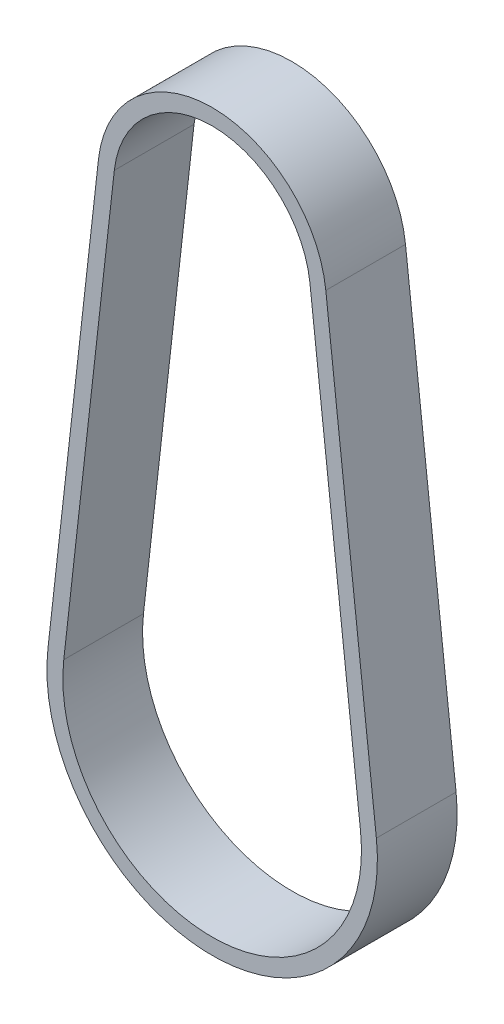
ISO-10303-21;
HEADER;
FILE_DESCRIPTION(('STEP AP214'),'2;1');
FILE_NAME('part.step','',(''),(''),'','','');
FILE_SCHEMA(('AUTOMOTIVE_DESIGN { 1 0 10303 214 1 1 1 1 }'));
ENDSEC;
DATA;
#1=APPLICATION_CONTEXT('core data for automotive mechanical design processes');
#2=APPLICATION_PROTOCOL_DEFINITION('international standard','automotive_design',2000,#1);
#3=PRODUCT_CONTEXT('',#1,'mechanical');
#4=PRODUCT('Part','Part','',(#3));
#5=PRODUCT_RELATED_PRODUCT_CATEGORY('part','',(#4));
#6=PRODUCT_DEFINITION_FORMATION('','',#4);
#7=PRODUCT_DEFINITION_CONTEXT('part definition',#1,'design');
#8=PRODUCT_DEFINITION('design','',#6,#7);
#9=PRODUCT_DEFINITION_SHAPE('','',#8);
#10=(LENGTH_UNIT() NAMED_UNIT(*) SI_UNIT(.MILLI.,.METRE.));
#11=(NAMED_UNIT(*) PLANE_ANGLE_UNIT() SI_UNIT($,.RADIAN.));
#12=(NAMED_UNIT(*) SI_UNIT($,.STERADIAN.) SOLID_ANGLE_UNIT());
#13=UNCERTAINTY_MEASURE_WITH_UNIT(LENGTH_MEASURE(1.E-05),#10,'distance_accuracy_value','');
#14=(GEOMETRIC_REPRESENTATION_CONTEXT(3) GLOBAL_UNCERTAINTY_ASSIGNED_CONTEXT((#13)) GLOBAL_UNIT_ASSIGNED_CONTEXT((#10,
#11,#12)) REPRESENTATION_CONTEXT('',''));
#15=CARTESIAN_POINT('',(0.,0.,0.));
#16=DIRECTION('',(0.,0.,1.));
#17=DIRECTION('',(1.,0.,0.));
#18=AXIS2_PLACEMENT_3D('',#15,#16,#17);
#19=CARTESIAN_POINT('',(-21.3898635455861,2.40818655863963,7.5));
#20=DIRECTION('',(-0.993721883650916,0.11187858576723,0.));
#21=DIRECTION('',(-0.11187858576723,-0.993721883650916,0.));
#22=AXIS2_PLACEMENT_3D('',#19,#20,#21);
#23=PLANE('',#22);
#24=DIRECTION('',(0.11187858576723,0.993721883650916,0.));
#25=VECTOR('',#24,1.);
#26=CARTESIAN_POINT('',(-21.3898635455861,2.40818655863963,-7.5));
#27=LINE('',#26,#25);
#28=CARTESIAN_POINT('',(-30.9047505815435,-82.1044250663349,-7.5));
#29=VERTEX_POINT('',#28);
#30=CARTESIAN_POINT('',(-21.3898635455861,2.40818655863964,-7.5));
#31=VERTEX_POINT('',#30);
#32=EDGE_CURVE('E163',#29,#31,#27,.T.);
#33=ORIENTED_EDGE('',*,*,#32,.F.);
#34=DIRECTION('',(0.,0.,-1.));
#35=VECTOR('',#34,1.);
#36=CARTESIAN_POINT('',(-30.9047505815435,-82.1044250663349,7.5));
#37=LINE('',#36,#35);
#38=CARTESIAN_POINT('',(-30.9047505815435,-82.1044250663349,7.5));
#39=VERTEX_POINT('',#38);
#40=EDGE_CURVE('E12',#39,#29,#37,.T.);
#41=ORIENTED_EDGE('',*,*,#40,.F.);
#42=DIRECTION('',(0.11187858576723,0.993721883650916,0.));
#43=VECTOR('',#42,1.);
#44=CARTESIAN_POINT('',(-21.3898635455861,2.40818655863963,7.5));
#45=LINE('',#44,#43);
#46=CARTESIAN_POINT('',(-21.3898635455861,2.40818655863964,7.5));
#47=VERTEX_POINT('',#46);
#48=EDGE_CURVE('E167',#39,#47,#45,.T.);
#49=ORIENTED_EDGE('',*,*,#48,.T.);
#50=DIRECTION('',(0.,0.,-1.));
#51=VECTOR('',#50,1.);
#52=CARTESIAN_POINT('',(-21.3898635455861,2.40818655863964,7.5));
#53=LINE('',#52,#51);
#54=EDGE_CURVE('E68',#47,#31,#53,.T.);
#55=ORIENTED_EDGE('',*,*,#54,.T.);
#56=EDGE_LOOP('',(#33,#41,#49,#55));
#57=FACE_BOUND('',#56,.T.);
#58=ADVANCED_FACE('F65',(#57),#23,.T.);
#59=CARTESIAN_POINT('',(0.,-85.5838490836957,7.5));
#60=DIRECTION('',(0.,0.,-1.));
#61=DIRECTION('',(-1.,0.,0.));
#62=AXIS2_PLACEMENT_3D('',#59,#60,#61);
#63=CYLINDRICAL_SURFACE('',#62,31.1);
#64=CARTESIAN_POINT('',(0.,-85.5838490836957,-7.5));
#65=DIRECTION('',(0.,0.,-1.));
#66=DIRECTION('',(-1.,0.,0.));
#67=AXIS2_PLACEMENT_3D('',#64,#65,#66);
#68=CIRCLE('',#67,31.1);
#69=CARTESIAN_POINT('',(30.9047505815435,-82.1044250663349,-7.5));
#70=VERTEX_POINT('',#69);
#71=EDGE_CURVE('E171',#70,#29,#68,.T.);
#72=ORIENTED_EDGE('',*,*,#71,.F.);
#73=DIRECTION('',(0.,0.,-1.));
#74=VECTOR('',#73,1.);
#75=CARTESIAN_POINT('',(30.9047505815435,-82.1044250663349,7.5));
#76=LINE('',#75,#74);
#77=CARTESIAN_POINT('',(30.9047505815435,-82.1044250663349,7.5));
#78=VERTEX_POINT('',#77);
#79=EDGE_CURVE('E73',#78,#70,#76,.T.);
#80=ORIENTED_EDGE('',*,*,#79,.F.);
#81=CARTESIAN_POINT('',(0.,-85.5838490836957,7.5));
#82=DIRECTION('',(0.,0.,-1.));
#83=DIRECTION('',(-1.,0.,0.));
#84=AXIS2_PLACEMENT_3D('',#81,#82,#83);
#85=CIRCLE('',#84,31.1);
#86=EDGE_CURVE('E177',#78,#39,#85,.T.);
#87=ORIENTED_EDGE('',*,*,#86,.T.);
#88=ORIENTED_EDGE('',*,*,#40,.T.);
#89=EDGE_LOOP('',(#72,#80,#87,#88));
#90=FACE_BOUND('',#89,.T.);
#91=ADVANCED_FACE('F203',(#90),#63,.T.);
#92=CARTESIAN_POINT('',(21.3898635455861,2.40818655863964,7.5));
#93=DIRECTION('',(0.993721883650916,0.11187858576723,0.));
#94=DIRECTION('',(-0.11187858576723,0.993721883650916,0.));
#95=AXIS2_PLACEMENT_3D('',#92,#93,#94);
#96=PLANE('',#95);
#97=DIRECTION('',(0.11187858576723,-0.993721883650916,0.));
#98=VECTOR('',#97,1.);
#99=CARTESIAN_POINT('',(21.3898635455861,2.40818655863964,-7.5));
#100=LINE('',#99,#98);
#101=CARTESIAN_POINT('',(21.3898635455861,2.40818655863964,-7.5));
#102=VERTEX_POINT('',#101);
#103=EDGE_CURVE('E185',#102,#70,#100,.T.);
#104=ORIENTED_EDGE('',*,*,#103,.F.);
#105=DIRECTION('',(0.,0.,-1.));
#106=VECTOR('',#105,1.);
#107=CARTESIAN_POINT('',(21.3898635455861,2.40818655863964,7.5));
#108=LINE('',#107,#106);
#109=CARTESIAN_POINT('',(21.3898635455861,2.40818655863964,7.5));
#110=VERTEX_POINT('',#109);
#111=EDGE_CURVE('E190',#110,#102,#108,.T.);
#112=ORIENTED_EDGE('',*,*,#111,.F.);
#113=DIRECTION('',(0.11187858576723,-0.993721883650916,0.));
#114=VECTOR('',#113,1.);
#115=CARTESIAN_POINT('',(21.3898635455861,2.40818655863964,7.5));
#116=LINE('',#115,#114);
#117=EDGE_CURVE('E174',#110,#78,#116,.T.);
#118=ORIENTED_EDGE('',*,*,#117,.T.);
#119=ORIENTED_EDGE('',*,*,#79,.T.);
#120=EDGE_LOOP('',(#104,#112,#118,#119));
#121=FACE_BOUND('',#120,.T.);
#122=ADVANCED_FACE('F207',(#121),#96,.T.);
#123=CARTESIAN_POINT('',(0.,0.,7.5));
#124=DIRECTION('',(0.,0.,-1.));
#125=DIRECTION('',(-1.,0.,0.));
#126=AXIS2_PLACEMENT_3D('',#123,#124,#125);
#127=CYLINDRICAL_SURFACE('',#126,21.5250000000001);
#128=CARTESIAN_POINT('',(0.,0.,-7.5));
#129=DIRECTION('',(0.,0.,-1.));
#130=DIRECTION('',(-1.,0.,0.));
#131=AXIS2_PLACEMENT_3D('',#128,#129,#130);
#132=CIRCLE('',#131,21.5250000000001);
#133=EDGE_CURVE('E182',#31,#102,#132,.T.);
#134=ORIENTED_EDGE('',*,*,#133,.F.);
#135=ORIENTED_EDGE('',*,*,#54,.F.);
#136=CARTESIAN_POINT('',(0.,0.,7.5));
#137=DIRECTION('',(0.,0.,-1.));
#138=DIRECTION('',(-1.,0.,0.));
#139=AXIS2_PLACEMENT_3D('',#136,#137,#138);
#140=CIRCLE('',#139,21.5250000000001);
#141=EDGE_CURVE('E170',#47,#110,#140,.T.);
#142=ORIENTED_EDGE('',*,*,#141,.T.);
#143=ORIENTED_EDGE('',*,*,#111,.T.);
#144=EDGE_LOOP('',(#134,#135,#142,#143));
#145=FACE_BOUND('',#144,.T.);
#146=ADVANCED_FACE('F198',(#145),#127,.T.);
#147=CARTESIAN_POINT('',(0.,0.,7.5));
#148=DIRECTION('',(0.,0.,-1.));
#149=DIRECTION('',(-1.,0.,0.));
#150=AXIS2_PLACEMENT_3D('',#147,#148,#149);
#151=PLANE('',#150);
#152=CARTESIAN_POINT('',(0.,-85.5838490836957,7.5));
#153=DIRECTION('',(0.,0.,-1.));
#154=DIRECTION('',(-1.,0.,0.));
#155=AXIS2_PLACEMENT_3D('',#152,#153,#154);
#156=CIRCLE('',#155,28.1);
#157=CARTESIAN_POINT('',(27.9235849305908,-82.4400608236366,7.5));
#158=VERTEX_POINT('',#157);
#159=CARTESIAN_POINT('',(-27.9235849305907,-82.4400608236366,7.5));
#160=VERTEX_POINT('',#159);
#161=EDGE_CURVE('E138',#158,#160,#156,.T.);
#162=ORIENTED_EDGE('',*,*,#161,.T.);
#163=DIRECTION('',(0.11187858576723,0.993721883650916,0.));
#164=VECTOR('',#163,1.);
#165=CARTESIAN_POINT('',(-18.4086978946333,2.07255080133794,7.5));
#166=LINE('',#165,#164);
#167=CARTESIAN_POINT('',(-18.4086978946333,2.07255080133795,7.5));
#168=VERTEX_POINT('',#167);
#169=EDGE_CURVE('E132',#160,#168,#166,.T.);
#170=ORIENTED_EDGE('',*,*,#169,.T.);
#171=CARTESIAN_POINT('',(0.,0.,7.5));
#172=DIRECTION('',(0.,0.,-1.));
#173=DIRECTION('',(-1.,0.,0.));
#174=AXIS2_PLACEMENT_3D('',#171,#172,#173);
#175=CIRCLE('',#174,18.5250000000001);
#176=CARTESIAN_POINT('',(18.4086978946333,2.07255080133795,7.5));
#177=VERTEX_POINT('',#176);
#178=EDGE_CURVE('E141',#168,#177,#175,.T.);
#179=ORIENTED_EDGE('',*,*,#178,.T.);
#180=DIRECTION('',(0.11187858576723,-0.993721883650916,0.));
#181=VECTOR('',#180,1.);
#182=CARTESIAN_POINT('',(18.4086978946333,2.07255080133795,7.5));
#183=LINE('',#182,#181);
#184=EDGE_CURVE('E81',#177,#158,#183,.T.);
#185=ORIENTED_EDGE('',*,*,#184,.T.);
#186=EDGE_LOOP('',(#162,#170,#179,#185));
#187=FACE_BOUND('',#186,.T.);
#188=ORIENTED_EDGE('',*,*,#48,.F.);
#189=ORIENTED_EDGE('',*,*,#86,.F.);
#190=ORIENTED_EDGE('',*,*,#117,.F.);
#191=ORIENTED_EDGE('',*,*,#141,.F.);
#192=EDGE_LOOP('',(#188,#189,#190,#191));
#193=FACE_BOUND('',#192,.T.);
#194=ADVANCED_FACE('F145',(#187,#193),#151,.F.);
#195=CARTESIAN_POINT('',(0.,0.,-7.5));
#196=DIRECTION('',(0.,0.,-1.));
#197=DIRECTION('',(-1.,0.,0.));
#198=AXIS2_PLACEMENT_3D('',#195,#196,#197);
#199=PLANE('',#198);
#200=DIRECTION('',(0.11187858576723,0.993721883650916,0.));
#201=VECTOR('',#200,1.);
#202=CARTESIAN_POINT('',(-18.4086978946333,2.07255080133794,-7.5));
#203=LINE('',#202,#201);
#204=CARTESIAN_POINT('',(-27.9235849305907,-82.4400608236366,-7.5));
#205=VERTEX_POINT('',#204);
#206=CARTESIAN_POINT('',(-18.4086978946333,2.07255080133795,-7.5));
#207=VERTEX_POINT('',#206);
#208=EDGE_CURVE('E89',#205,#207,#203,.T.);
#209=ORIENTED_EDGE('',*,*,#208,.F.);
#210=CARTESIAN_POINT('',(0.,-85.5838490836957,-7.5));
#211=DIRECTION('',(0.,0.,-1.));
#212=DIRECTION('',(-1.,0.,0.));
#213=AXIS2_PLACEMENT_3D('',#210,#211,#212);
#214=CIRCLE('',#213,28.1);
#215=CARTESIAN_POINT('',(27.9235849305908,-82.4400608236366,-7.5));
#216=VERTEX_POINT('',#215);
#217=EDGE_CURVE('E148',#216,#205,#214,.T.);
#218=ORIENTED_EDGE('',*,*,#217,.F.);
#219=DIRECTION('',(0.11187858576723,-0.993721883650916,0.));
#220=VECTOR('',#219,1.);
#221=CARTESIAN_POINT('',(18.4086978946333,2.07255080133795,-7.5));
#222=LINE('',#221,#220);
#223=CARTESIAN_POINT('',(18.4086978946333,2.07255080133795,-7.5));
#224=VERTEX_POINT('',#223);
#225=EDGE_CURVE('E151',#224,#216,#222,.T.);
#226=ORIENTED_EDGE('',*,*,#225,.F.);
#227=CARTESIAN_POINT('',(0.,0.,-7.5));
#228=DIRECTION('',(0.,0.,-1.));
#229=DIRECTION('',(-1.,0.,0.));
#230=AXIS2_PLACEMENT_3D('',#227,#228,#229);
#231=CIRCLE('',#230,18.5250000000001);
#232=EDGE_CURVE('E157',#207,#224,#231,.T.);
#233=ORIENTED_EDGE('',*,*,#232,.F.);
#234=EDGE_LOOP('',(#209,#218,#226,#233));
#235=FACE_BOUND('',#234,.T.);
#236=ORIENTED_EDGE('',*,*,#32,.T.);
#237=ORIENTED_EDGE('',*,*,#133,.T.);
#238=ORIENTED_EDGE('',*,*,#103,.T.);
#239=ORIENTED_EDGE('',*,*,#71,.T.);
#240=EDGE_LOOP('',(#236,#237,#238,#239));
#241=FACE_BOUND('',#240,.T.);
#242=ADVANCED_FACE('F200',(#235,#241),#199,.T.);
#243=CARTESIAN_POINT('',(-18.4086978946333,2.07255080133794,7.5));
#244=DIRECTION('',(-0.993721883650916,0.11187858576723,0.));
#245=DIRECTION('',(-0.11187858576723,-0.993721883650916,0.));
#246=AXIS2_PLACEMENT_3D('',#243,#244,#245);
#247=PLANE('',#246);
#248=ORIENTED_EDGE('',*,*,#208,.T.);
#249=DIRECTION('',(0.,0.,-1.));
#250=VECTOR('',#249,1.);
#251=CARTESIAN_POINT('',(-18.4086978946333,2.07255080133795,7.5));
#252=LINE('',#251,#250);
#253=EDGE_CURVE('E128',#168,#207,#252,.T.);
#254=ORIENTED_EDGE('',*,*,#253,.F.);
#255=ORIENTED_EDGE('',*,*,#169,.F.);
#256=DIRECTION('',(0.,0.,-1.));
#257=VECTOR('',#256,1.);
#258=CARTESIAN_POINT('',(-27.9235849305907,-82.4400608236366,7.5));
#259=LINE('',#258,#257);
#260=EDGE_CURVE('E161',#160,#205,#259,.T.);
#261=ORIENTED_EDGE('',*,*,#260,.T.);
#262=EDGE_LOOP('',(#248,#254,#255,#261));
#263=FACE_BOUND('',#262,.T.);
#264=ADVANCED_FACE('F130',(#263),#247,.F.);
#265=CARTESIAN_POINT('',(0.,-85.5838490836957,7.5));
#266=DIRECTION('',(0.,0.,-1.));
#267=DIRECTION('',(-1.,0.,0.));
#268=AXIS2_PLACEMENT_3D('',#265,#266,#267);
#269=CYLINDRICAL_SURFACE('',#268,28.1);
#270=ORIENTED_EDGE('',*,*,#217,.T.);
#271=ORIENTED_EDGE('',*,*,#260,.F.);
#272=ORIENTED_EDGE('',*,*,#161,.F.);
#273=DIRECTION('',(0.,0.,-1.));
#274=VECTOR('',#273,1.);
#275=CARTESIAN_POINT('',(27.9235849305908,-82.4400608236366,7.5));
#276=LINE('',#275,#274);
#277=EDGE_CURVE('E164',#158,#216,#276,.T.);
#278=ORIENTED_EDGE('',*,*,#277,.T.);
#279=EDGE_LOOP('',(#270,#271,#272,#278));
#280=FACE_BOUND('',#279,.T.);
#281=ADVANCED_FACE('F260',(#280),#269,.F.);
#282=CARTESIAN_POINT('',(18.4086978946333,2.07255080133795,7.5));
#283=DIRECTION('',(0.993721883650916,0.11187858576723,0.));
#284=DIRECTION('',(-0.11187858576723,0.993721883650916,0.));
#285=AXIS2_PLACEMENT_3D('',#282,#283,#284);
#286=PLANE('',#285);
#287=ORIENTED_EDGE('',*,*,#225,.T.);
#288=ORIENTED_EDGE('',*,*,#277,.F.);
#289=ORIENTED_EDGE('',*,*,#184,.F.);
#290=DIRECTION('',(0.,0.,-1.));
#291=VECTOR('',#290,1.);
#292=CARTESIAN_POINT('',(18.4086978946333,2.07255080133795,7.5));
#293=LINE('',#292,#291);
#294=EDGE_CURVE('E137',#177,#224,#293,.T.);
#295=ORIENTED_EDGE('',*,*,#294,.T.);
#296=EDGE_LOOP('',(#287,#288,#289,#295));
#297=FACE_BOUND('',#296,.T.);
#298=ADVANCED_FACE('F269',(#297),#286,.F.);
#299=CARTESIAN_POINT('',(0.,0.,7.5));
#300=DIRECTION('',(0.,0.,-1.));
#301=DIRECTION('',(-1.,0.,0.));
#302=AXIS2_PLACEMENT_3D('',#299,#300,#301);
#303=CYLINDRICAL_SURFACE('',#302,18.5250000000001);
#304=ORIENTED_EDGE('',*,*,#232,.T.);
#305=ORIENTED_EDGE('',*,*,#294,.F.);
#306=ORIENTED_EDGE('',*,*,#178,.F.);
#307=ORIENTED_EDGE('',*,*,#253,.T.);
#308=EDGE_LOOP('',(#304,#305,#306,#307));
#309=FACE_BOUND('',#308,.T.);
#310=ADVANCED_FACE('F142',(#309),#303,.F.);
#311=CLOSED_SHELL('',(#58,#91,#122,#146,#194,#242,#264,#281,#298,#310));
#312=MANIFOLD_SOLID_BREP('B2',#311);
#313=ADVANCED_BREP_SHAPE_REPRESENTATION('',(#18,#312),#14);
#314=SHAPE_DEFINITION_REPRESENTATION(#9,#313);
ENDSEC;
END-ISO-10303-21;
